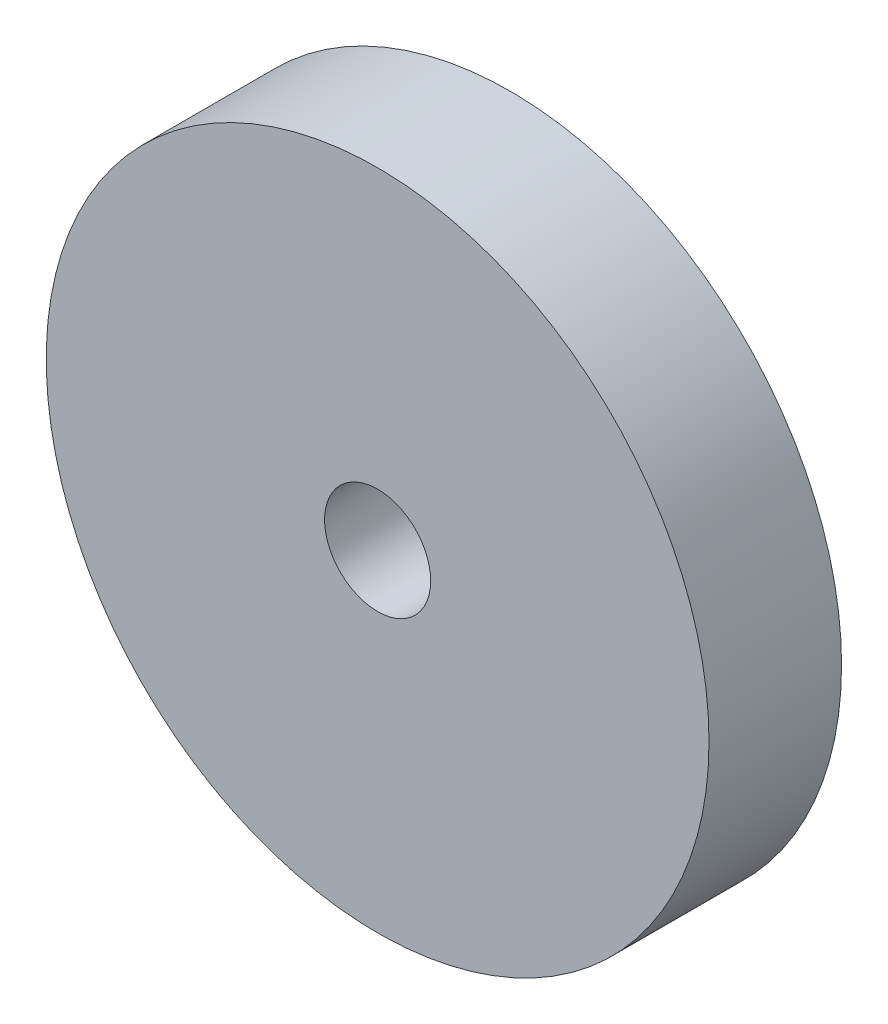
from build123d import *

# Parameters (mm, degrees)
SKETCH1_R           = 25
SKETCH1_R_2         = 4
BOSS_EXTRUDE1_DEPTH = 10


with BuildPart() as part:
    # Sketch1 → Boss-Extrude1 (new body)
    with BuildSketch(Plane.XY):
        Circle(SKETCH1_R)
        Circle(SKETCH1_R_2, mode=Mode.SUBTRACT)
    extrude(amount=BOSS_EXTRUDE1_DEPTH)


solid = part.part
